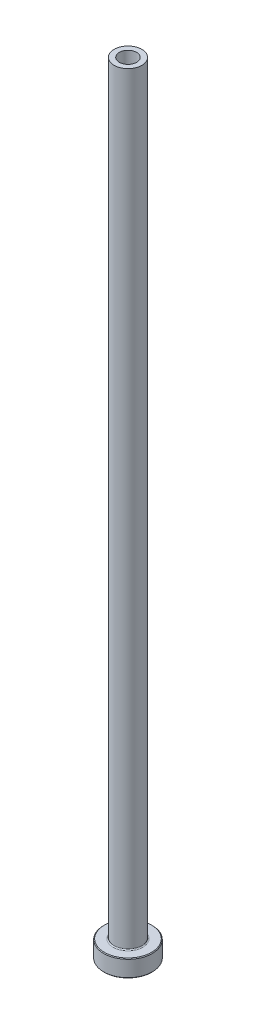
ISO-10303-21;
HEADER;
FILE_DESCRIPTION(('STEP AP214'),'2;1');
FILE_NAME('part.step','',(''),(''),'','','');
FILE_SCHEMA(('AUTOMOTIVE_DESIGN { 1 0 10303 214 1 1 1 1 }'));
ENDSEC;
DATA;
#1=APPLICATION_CONTEXT('core data for automotive mechanical design processes');
#2=APPLICATION_PROTOCOL_DEFINITION('international standard','automotive_design',2000,#1);
#3=PRODUCT_CONTEXT('',#1,'mechanical');
#4=PRODUCT('Part','Part','',(#3));
#5=PRODUCT_RELATED_PRODUCT_CATEGORY('part','',(#4));
#6=PRODUCT_DEFINITION_FORMATION('','',#4);
#7=PRODUCT_DEFINITION_CONTEXT('part definition',#1,'design');
#8=PRODUCT_DEFINITION('design','',#6,#7);
#9=PRODUCT_DEFINITION_SHAPE('','',#8);
#10=(LENGTH_UNIT() NAMED_UNIT(*) SI_UNIT(.MILLI.,.METRE.));
#11=(NAMED_UNIT(*) PLANE_ANGLE_UNIT() SI_UNIT($,.RADIAN.));
#12=(NAMED_UNIT(*) SI_UNIT($,.STERADIAN.) SOLID_ANGLE_UNIT());
#13=UNCERTAINTY_MEASURE_WITH_UNIT(LENGTH_MEASURE(1.E-05),#10,'distance_accuracy_value','');
#14=(GEOMETRIC_REPRESENTATION_CONTEXT(3) GLOBAL_UNCERTAINTY_ASSIGNED_CONTEXT((#13)) GLOBAL_UNIT_ASSIGNED_CONTEXT((#10,
#11,#12)) REPRESENTATION_CONTEXT('',''));
#15=CARTESIAN_POINT('',(0.,0.,0.));
#16=DIRECTION('',(0.,0.,1.));
#17=DIRECTION('',(1.,0.,0.));
#18=AXIS2_PLACEMENT_3D('',#15,#16,#17);
#19=CARTESIAN_POINT('',(0.,92.1876809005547,0.));
#20=DIRECTION('',(0.,1.,0.));
#21=DIRECTION('',(0.,0.,1.));
#22=AXIS2_PLACEMENT_3D('',#19,#20,#21);
#23=CYLINDRICAL_SURFACE('',#22,2.50000000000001);
#24=CARTESIAN_POINT('',(0.,225.,0.));
#25=DIRECTION('',(0.,1.,0.));
#26=DIRECTION('',(0.,0.,1.));
#27=AXIS2_PLACEMENT_3D('',#24,#25,#26);
#28=CIRCLE('',#27,2.50000000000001);
#29=CARTESIAN_POINT('',(0.,225.,2.50000000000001));
#30=VERTEX_POINT('',#29);
#31=EDGE_CURVE('E62',#30,#30,#28,.T.);
#32=ORIENTED_EDGE('',*,*,#31,.T.);
#33=EDGE_LOOP('',(#32));
#34=FACE_BOUND('',#33,.T.);
#35=CARTESIAN_POINT('',(0.,180.,0.));
#36=DIRECTION('',(0.,1.,0.));
#37=DIRECTION('',(0.,0.,1.));
#38=AXIS2_PLACEMENT_3D('',#35,#36,#37);
#39=CIRCLE('',#38,2.50000000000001);
#40=CARTESIAN_POINT('',(0.,180.,2.50000000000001));
#41=VERTEX_POINT('',#40);
#42=EDGE_CURVE('E71',#41,#41,#39,.T.);
#43=ORIENTED_EDGE('',*,*,#42,.F.);
#44=EDGE_LOOP('',(#43));
#45=FACE_BOUND('',#44,.T.);
#46=ADVANCED_FACE('F30',(#34,#45),#23,.F.);
#47=CARTESIAN_POINT('',(-2.50000000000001,225.,0.));
#48=DIRECTION('',(0.,1.,0.));
#49=DIRECTION('',(0.,0.,1.));
#50=AXIS2_PLACEMENT_3D('',#47,#48,#49);
#51=PLANE('',#50);
#52=CARTESIAN_POINT('',(0.,225.,0.));
#53=DIRECTION('',(0.,1.,0.));
#54=DIRECTION('',(0.,0.,1.));
#55=AXIS2_PLACEMENT_3D('',#52,#53,#54);
#56=CIRCLE('',#55,4.00000000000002);
#57=CARTESIAN_POINT('',(0.,225.,4.00000000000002));
#58=VERTEX_POINT('',#57);
#59=EDGE_CURVE('E65',#58,#58,#56,.T.);
#60=ORIENTED_EDGE('',*,*,#59,.T.);
#61=EDGE_LOOP('',(#60));
#62=FACE_BOUND('',#61,.T.);
#63=ORIENTED_EDGE('',*,*,#31,.F.);
#64=EDGE_LOOP('',(#63));
#65=FACE_BOUND('',#64,.T.);
#66=ADVANCED_FACE('F79',(#62,#65),#51,.T.);
#67=CARTESIAN_POINT('',(0.,92.1876809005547,0.));
#68=DIRECTION('',(0.,1.,0.));
#69=DIRECTION('',(0.,0.,1.));
#70=AXIS2_PLACEMENT_3D('',#67,#68,#69);
#71=CYLINDRICAL_SURFACE('',#70,4.);
#72=CARTESIAN_POINT('',(0.,5.3,0.));
#73=DIRECTION('',(0.,1.,0.));
#74=DIRECTION('',(0.,0.,1.));
#75=AXIS2_PLACEMENT_3D('',#72,#73,#74);
#76=CIRCLE('',#75,4.);
#77=CARTESIAN_POINT('',(0.,5.3,4.));
#78=VERTEX_POINT('',#77);
#79=EDGE_CURVE('E59',#78,#78,#76,.T.);
#80=ORIENTED_EDGE('',*,*,#79,.T.);
#81=EDGE_LOOP('',(#80));
#82=FACE_BOUND('',#81,.T.);
#83=ORIENTED_EDGE('',*,*,#59,.F.);
#84=EDGE_LOOP('',(#83));
#85=FACE_BOUND('',#84,.T.);
#86=ADVANCED_FACE('F85',(#82,#85),#71,.T.);
#87=CARTESIAN_POINT('',(-3.99999999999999,5.,0.));
#88=DIRECTION('',(0.,1.,0.));
#89=DIRECTION('',(0.,0.,1.));
#90=AXIS2_PLACEMENT_3D('',#87,#88,#89);
#91=PLANE('',#90);
#92=CARTESIAN_POINT('',(0.,5.,0.));
#93=DIRECTION('',(0.,1.,0.));
#94=DIRECTION('',(0.,0.,1.));
#95=AXIS2_PLACEMENT_3D('',#92,#93,#94);
#96=CIRCLE('',#95,6.79999999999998);
#97=CARTESIAN_POINT('',(0.,5.,6.79999999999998));
#98=VERTEX_POINT('',#97);
#99=EDGE_CURVE('E53',#98,#98,#96,.T.);
#100=ORIENTED_EDGE('',*,*,#99,.T.);
#101=EDGE_LOOP('',(#100));
#102=FACE_BOUND('',#101,.T.);
#103=CARTESIAN_POINT('',(0.,5.,0.));
#104=DIRECTION('',(0.,1.,0.));
#105=DIRECTION('',(0.,0.,1.));
#106=AXIS2_PLACEMENT_3D('',#103,#104,#105);
#107=CIRCLE('',#106,4.3);
#108=CARTESIAN_POINT('',(0.,5.,4.3));
#109=VERTEX_POINT('',#108);
#110=EDGE_CURVE('E56',#109,#109,#107,.F.);
#111=ORIENTED_EDGE('',*,*,#110,.T.);
#112=EDGE_LOOP('',(#111));
#113=FACE_BOUND('',#112,.T.);
#114=ADVANCED_FACE('F111',(#102,#113),#91,.T.);
#115=CARTESIAN_POINT('',(0.,92.1876809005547,0.));
#116=DIRECTION('',(0.,1.,0.));
#117=DIRECTION('',(0.,0.,1.));
#118=AXIS2_PLACEMENT_3D('',#115,#116,#117);
#119=CYLINDRICAL_SURFACE('',#118,6.99999999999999);
#120=CARTESIAN_POINT('',(0.,4.79999999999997,0.));
#121=DIRECTION('',(0.,1.,0.));
#122=DIRECTION('',(0.,0.,1.));
#123=AXIS2_PLACEMENT_3D('',#120,#121,#122);
#124=CIRCLE('',#123,6.99999999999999);
#125=CARTESIAN_POINT('',(0.,4.79999999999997,6.99999999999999));
#126=VERTEX_POINT('',#125);
#127=EDGE_CURVE('E45',#126,#126,#124,.F.);
#128=ORIENTED_EDGE('',*,*,#127,.T.);
#129=EDGE_LOOP('',(#128));
#130=FACE_BOUND('',#129,.T.);
#131=CARTESIAN_POINT('',(0.,0.20000000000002,0.));
#132=DIRECTION('',(0.,-1.,0.));
#133=DIRECTION('',(0.,0.,-1.));
#134=AXIS2_PLACEMENT_3D('',#131,#132,#133);
#135=CIRCLE('',#134,6.99999999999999);
#136=CARTESIAN_POINT('',(0.,0.20000000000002,-6.99999999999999));
#137=VERTEX_POINT('',#136);
#138=EDGE_CURVE('E50',#137,#137,#135,.F.);
#139=ORIENTED_EDGE('',*,*,#138,.T.);
#140=EDGE_LOOP('',(#139));
#141=FACE_BOUND('',#140,.T.);
#142=ADVANCED_FACE('F108',(#130,#141),#119,.T.);
#143=CARTESIAN_POINT('',(-6.99999999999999,0.,0.));
#144=DIRECTION('',(0.,-1.,0.));
#145=DIRECTION('',(0.,0.,-1.));
#146=AXIS2_PLACEMENT_3D('',#143,#144,#145);
#147=PLANE('',#146);
#148=CARTESIAN_POINT('',(0.,0.,0.));
#149=DIRECTION('',(0.,-1.,0.));
#150=DIRECTION('',(0.,0.,-1.));
#151=AXIS2_PLACEMENT_3D('',#148,#149,#150);
#152=CIRCLE('',#151,3.25);
#153=CARTESIAN_POINT('',(0.,0.,-3.25));
#154=VERTEX_POINT('',#153);
#155=EDGE_CURVE('E37',#154,#154,#152,.F.);
#156=ORIENTED_EDGE('',*,*,#155,.T.);
#157=EDGE_LOOP('',(#156));
#158=FACE_BOUND('',#157,.T.);
#159=CARTESIAN_POINT('',(0.,0.,0.));
#160=DIRECTION('',(0.,-1.,0.));
#161=DIRECTION('',(0.,0.,-1.));
#162=AXIS2_PLACEMENT_3D('',#159,#160,#161);
#163=CIRCLE('',#162,6.79999999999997);
#164=CARTESIAN_POINT('',(0.,0.,-6.79999999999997));
#165=VERTEX_POINT('',#164);
#166=EDGE_CURVE('E41',#165,#165,#163,.T.);
#167=ORIENTED_EDGE('',*,*,#166,.T.);
#168=EDGE_LOOP('',(#167));
#169=FACE_BOUND('',#168,.T.);
#170=ADVANCED_FACE('F110',(#158,#169),#147,.T.);
#171=CARTESIAN_POINT('',(0.,92.1876809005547,0.));
#172=DIRECTION('',(0.,1.,0.));
#173=DIRECTION('',(0.,0.,1.));
#174=AXIS2_PLACEMENT_3D('',#171,#172,#173);
#175=CYLINDRICAL_SURFACE('',#174,2.75);
#176=CARTESIAN_POINT('',(0.,0.500000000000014,0.));
#177=DIRECTION('',(0.,-1.,0.));
#178=DIRECTION('',(0.,0.,-1.));
#179=AXIS2_PLACEMENT_3D('',#176,#177,#178);
#180=CIRCLE('',#179,2.75);
#181=CARTESIAN_POINT('',(0.,0.500000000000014,-2.75));
#182=VERTEX_POINT('',#181);
#183=EDGE_CURVE('E10',#182,#182,#180,.T.);
#184=ORIENTED_EDGE('',*,*,#183,.T.);
#185=EDGE_LOOP('',(#184));
#186=FACE_BOUND('',#185,.T.);
#187=CARTESIAN_POINT('',(0.,168.,0.));
#188=DIRECTION('',(0.,1.,0.));
#189=DIRECTION('',(0.,0.,1.));
#190=AXIS2_PLACEMENT_3D('',#187,#188,#189);
#191=CIRCLE('',#190,2.75000000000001);
#192=CARTESIAN_POINT('',(0.,168.,2.75000000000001));
#193=VERTEX_POINT('',#192);
#194=EDGE_CURVE('E68',#193,#193,#191,.T.);
#195=ORIENTED_EDGE('',*,*,#194,.T.);
#196=EDGE_LOOP('',(#195));
#197=FACE_BOUND('',#196,.T.);
#198=ADVANCED_FACE('F118',(#186,#197),#175,.F.);
#199=CARTESIAN_POINT('',(0.,168.,0.));
#200=DIRECTION('',(0.,-1.,0.));
#201=DIRECTION('',(0.,0.,-1.));
#202=AXIS2_PLACEMENT_3D('',#199,#200,#201);
#203=CONICAL_SURFACE('',#202,2.75000000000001,0.0208303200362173);
#204=ORIENTED_EDGE('',*,*,#42,.T.);
#205=EDGE_LOOP('',(#204));
#206=FACE_BOUND('',#205,.T.);
#207=ORIENTED_EDGE('',*,*,#194,.F.);
#208=EDGE_LOOP('',(#207));
#209=FACE_BOUND('',#208,.T.);
#210=ADVANCED_FACE('F75',(#206,#209),#203,.F.);
#211=CARTESIAN_POINT('',(0.,5.3,0.));
#212=DIRECTION('',(0.,1.,0.));
#213=DIRECTION('',(0.,0.,1.));
#214=AXIS2_PLACEMENT_3D('',#211,#212,#213);
#215=TOROIDAL_SURFACE('',#214,4.3,0.3);
#216=ORIENTED_EDGE('',*,*,#110,.F.);
#217=EDGE_LOOP('',(#216));
#218=FACE_BOUND('',#217,.T.);
#219=ORIENTED_EDGE('',*,*,#79,.F.);
#220=EDGE_LOOP('',(#219));
#221=FACE_BOUND('',#220,.T.);
#222=ADVANCED_FACE('F90',(#218,#221),#215,.F.);
#223=CARTESIAN_POINT('',(0.,5.,0.));
#224=DIRECTION('',(0.,-1.,0.));
#225=DIRECTION('',(0.,0.,-1.));
#226=AXIS2_PLACEMENT_3D('',#223,#224,#225);
#227=CONICAL_SURFACE('',#226,6.79999999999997,0.785398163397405);
#228=ORIENTED_EDGE('',*,*,#127,.F.);
#229=EDGE_LOOP('',(#228));
#230=FACE_BOUND('',#229,.T.);
#231=ORIENTED_EDGE('',*,*,#99,.F.);
#232=EDGE_LOOP('',(#231));
#233=FACE_BOUND('',#232,.T.);
#234=ADVANCED_FACE('F93',(#230,#233),#227,.T.);
#235=CARTESIAN_POINT('',(0.,0.20000000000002,0.));
#236=DIRECTION('',(0.,1.,0.));
#237=DIRECTION('',(0.,0.,1.));
#238=AXIS2_PLACEMENT_3D('',#235,#236,#237);
#239=CONICAL_SURFACE('',#238,6.99999999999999,0.78539816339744);
#240=ORIENTED_EDGE('',*,*,#166,.F.);
#241=EDGE_LOOP('',(#240));
#242=FACE_BOUND('',#241,.T.);
#243=ORIENTED_EDGE('',*,*,#138,.F.);
#244=EDGE_LOOP('',(#243));
#245=FACE_BOUND('',#244,.T.);
#246=ADVANCED_FACE('F96',(#242,#245),#239,.T.);
#247=CARTESIAN_POINT('',(0.,0.,0.));
#248=DIRECTION('',(0.,-1.,0.));
#249=DIRECTION('',(0.,0.,-1.));
#250=AXIS2_PLACEMENT_3D('',#247,#248,#249);
#251=CONICAL_SURFACE('',#250,3.25,0.785398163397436);
#252=ORIENTED_EDGE('',*,*,#183,.F.);
#253=EDGE_LOOP('',(#252));
#254=FACE_BOUND('',#253,.T.);
#255=ORIENTED_EDGE('',*,*,#155,.F.);
#256=EDGE_LOOP('',(#255));
#257=FACE_BOUND('',#256,.T.);
#258=ADVANCED_FACE('F32',(#254,#257),#251,.F.);
#259=CLOSED_SHELL('',(#46,#66,#86,#114,#142,#170,#198,#210,#222,#234,#246,#258));
#260=MANIFOLD_SOLID_BREP('B2',#259);
#261=ADVANCED_BREP_SHAPE_REPRESENTATION('',(#18,#260),#14);
#262=SHAPE_DEFINITION_REPRESENTATION(#9,#261);
ENDSEC;
END-ISO-10303-21;
